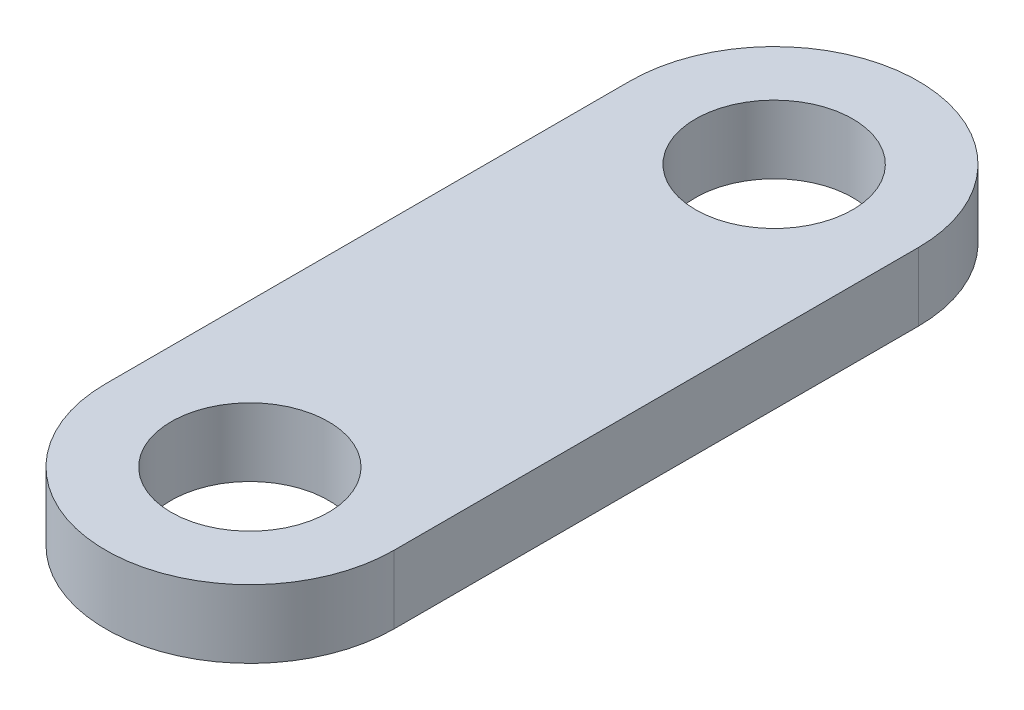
from build123d import *

# Parameters (mm, degrees)
SKETCH_1_R      = 3
EXTRUDE_1_DEPTH = 2.6


with BuildPart() as part:
    # Sketch 1 → Extrude 1 (new body)
    with BuildSketch(Plane(origin=(0, 0, 0), x_dir=(1, 0, 0), z_dir=(0, 1, 0))):
        with BuildLine():
            Line((-5.5, 10.260338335), (-5.5, -9.739661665))
            ThreePointArc((-5.5, -9.739661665), (0, -15.239661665), (5.5, -9.739661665))
            Line((5.5, -9.739661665), (5.5, 10.260338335))
            ThreePointArc((5.5, 10.260338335), (0, 15.760338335), (-5.5, 10.260338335))
        make_face()
        with Locations(Location((0, 10.260338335, 0), (0, 0, 270))):
            Circle(SKETCH_1_R, mode=Mode.SUBTRACT)
        with Locations(Location((0, -9.739661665, 0), (0, 0, 270))):
            Circle(SKETCH_1_R, mode=Mode.SUBTRACT)
    extrude(amount=EXTRUDE_1_DEPTH)


solid = part.part
